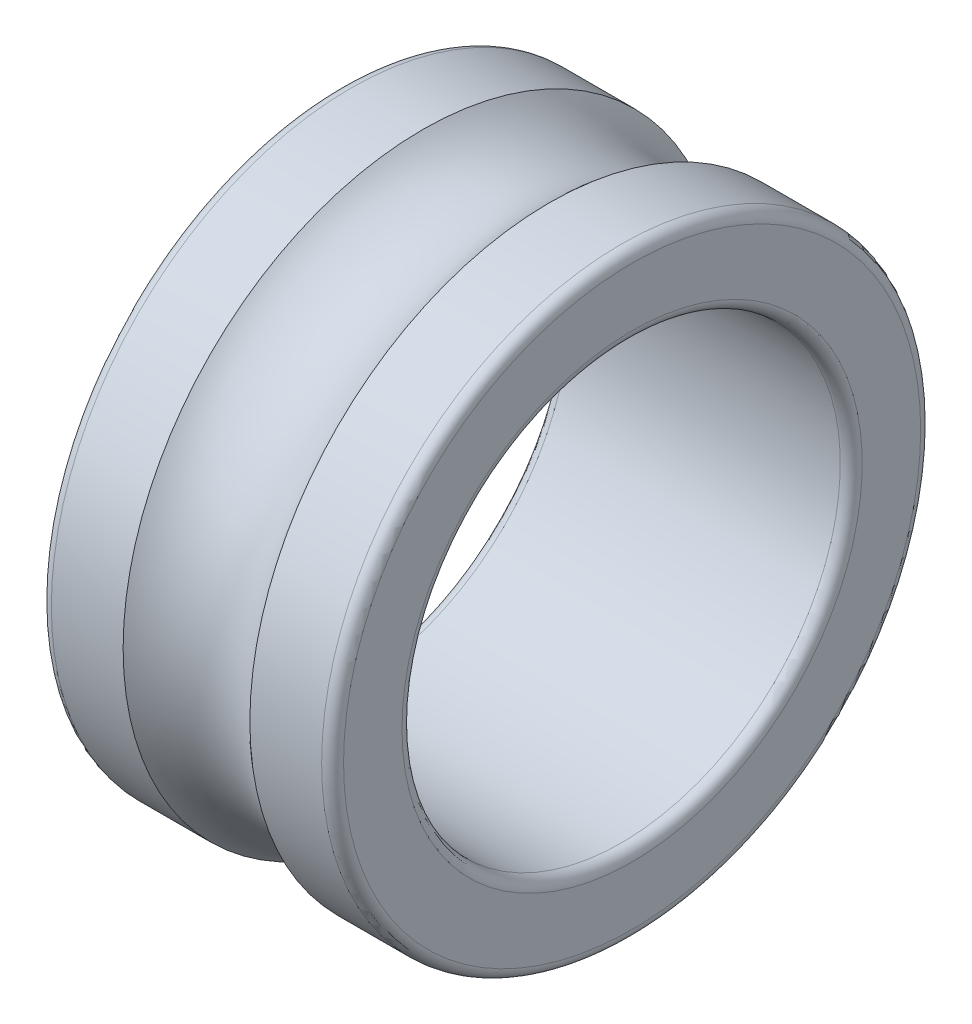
ISO-10303-21;
HEADER;
FILE_DESCRIPTION(('STEP AP214'),'2;1');
FILE_NAME('part.step','',(''),(''),'','','');
FILE_SCHEMA(('AUTOMOTIVE_DESIGN { 1 0 10303 214 1 1 1 1 }'));
ENDSEC;
DATA;
#1=APPLICATION_CONTEXT('core data for automotive mechanical design processes');
#2=APPLICATION_PROTOCOL_DEFINITION('international standard','automotive_design',2000,#1);
#3=PRODUCT_CONTEXT('',#1,'mechanical');
#4=PRODUCT('Part','Part','',(#3));
#5=PRODUCT_RELATED_PRODUCT_CATEGORY('part','',(#4));
#6=PRODUCT_DEFINITION_FORMATION('','',#4);
#7=PRODUCT_DEFINITION_CONTEXT('part definition',#1,'design');
#8=PRODUCT_DEFINITION('design','',#6,#7);
#9=PRODUCT_DEFINITION_SHAPE('','',#8);
#10=(LENGTH_UNIT() NAMED_UNIT(*) SI_UNIT(.MILLI.,.METRE.));
#11=(NAMED_UNIT(*) PLANE_ANGLE_UNIT() SI_UNIT($,.RADIAN.));
#12=(NAMED_UNIT(*) SI_UNIT($,.STERADIAN.) SOLID_ANGLE_UNIT());
#13=UNCERTAINTY_MEASURE_WITH_UNIT(LENGTH_MEASURE(1.E-05),#10,'distance_accuracy_value','');
#14=(GEOMETRIC_REPRESENTATION_CONTEXT(3) GLOBAL_UNCERTAINTY_ASSIGNED_CONTEXT((#13)) GLOBAL_UNIT_ASSIGNED_CONTEXT((#10,
#11,#12)) REPRESENTATION_CONTEXT('',''));
#15=CARTESIAN_POINT('',(0.,0.,0.));
#16=DIRECTION('',(0.,0.,1.));
#17=DIRECTION('',(1.,0.,0.));
#18=AXIS2_PLACEMENT_3D('',#15,#16,#17);
#19=CARTESIAN_POINT('',(-4.,0.,0.));
#20=DIRECTION('',(-1.,0.,0.));
#21=DIRECTION('',(0.,0.,1.));
#22=AXIS2_PLACEMENT_3D('',#19,#20,#21);
#23=TOROIDAL_SURFACE('',#22,10.,2.5);
#24=CARTESIAN_POINT('',(-5.73493515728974,0.,0.));
#25=DIRECTION('',(-1.,0.,0.));
#26=DIRECTION('',(0.,0.,1.));
#27=AXIS2_PLACEMENT_3D('',#24,#25,#26);
#28=CIRCLE('',#27,8.2);
#29=CARTESIAN_POINT('',(-5.73493515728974,0.,8.2));
#30=VERTEX_POINT('',#29);
#31=EDGE_CURVE('E10',#30,#30,#28,.T.);
#32=ORIENTED_EDGE('',*,*,#31,.F.);
#33=EDGE_LOOP('',(#32));
#34=FACE_BOUND('',#33,.T.);
#35=CARTESIAN_POINT('',(-2.26506484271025,0.,0.));
#36=DIRECTION('',(-1.,0.,0.));
#37=DIRECTION('',(0.,0.,1.));
#38=AXIS2_PLACEMENT_3D('',#35,#36,#37);
#39=CIRCLE('',#38,8.2);
#40=CARTESIAN_POINT('',(-2.26506484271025,0.,8.2));
#41=VERTEX_POINT('',#40);
#42=EDGE_CURVE('E388',#41,#41,#39,.T.);
#43=ORIENTED_EDGE('',*,*,#42,.T.);
#44=EDGE_LOOP('',(#43));
#45=FACE_BOUND('',#44,.T.);
#46=ADVANCED_FACE('F354',(#34,#45),#23,.F.);
#47=CARTESIAN_POINT('',(-60.,0.,0.));
#48=DIRECTION('',(-1.,0.,0.));
#49=DIRECTION('',(0.,0.,1.));
#50=AXIS2_PLACEMENT_3D('',#47,#48,#49);
#51=CYLINDRICAL_SURFACE('',#50,8.2);
#52=CARTESIAN_POINT('',(-7.69999999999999,0.,0.));
#53=DIRECTION('',(-1.,0.,0.));
#54=DIRECTION('',(0.,0.,1.));
#55=AXIS2_PLACEMENT_3D('',#52,#53,#54);
#56=CIRCLE('',#55,8.2);
#57=CARTESIAN_POINT('',(-7.69999999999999,0.,8.2));
#58=VERTEX_POINT('',#57);
#59=EDGE_CURVE('E360',#58,#58,#56,.T.);
#60=ORIENTED_EDGE('',*,*,#59,.F.);
#61=EDGE_LOOP('',(#60));
#62=FACE_BOUND('',#61,.T.);
#63=ORIENTED_EDGE('',*,*,#31,.T.);
#64=EDGE_LOOP('',(#63));
#65=FACE_BOUND('',#64,.T.);
#66=ADVANCED_FACE('F437',(#62,#65),#51,.T.);
#67=CARTESIAN_POINT('',(-7.69999999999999,0.,0.));
#68=DIRECTION('',(-1.,0.,0.));
#69=DIRECTION('',(0.,0.,1.));
#70=AXIS2_PLACEMENT_3D('',#67,#68,#69);
#71=TOROIDAL_SURFACE('',#70,7.9,0.3);
#72=CARTESIAN_POINT('',(-7.99999999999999,0.,0.));
#73=DIRECTION('',(-1.,0.,0.));
#74=DIRECTION('',(0.,0.,1.));
#75=AXIS2_PLACEMENT_3D('',#72,#73,#74);
#76=CIRCLE('',#75,7.9);
#77=CARTESIAN_POINT('',(-7.99999999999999,0.,7.9));
#78=VERTEX_POINT('',#77);
#79=EDGE_CURVE('E364',#78,#78,#76,.T.);
#80=ORIENTED_EDGE('',*,*,#79,.F.);
#81=EDGE_LOOP('',(#80));
#82=FACE_BOUND('',#81,.T.);
#83=ORIENTED_EDGE('',*,*,#59,.T.);
#84=EDGE_LOOP('',(#83));
#85=FACE_BOUND('',#84,.T.);
#86=ADVANCED_FACE('F432',(#82,#85),#71,.T.);
#87=CARTESIAN_POINT('',(-7.99999999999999,7.9,0.));
#88=DIRECTION('',(1.,0.,0.));
#89=DIRECTION('',(0.,0.,-1.));
#90=AXIS2_PLACEMENT_3D('',#87,#88,#89);
#91=PLANE('',#90);
#92=CARTESIAN_POINT('',(-7.99999999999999,0.,0.));
#93=DIRECTION('',(-1.,0.,0.));
#94=DIRECTION('',(0.,0.,1.));
#95=AXIS2_PLACEMENT_3D('',#92,#93,#94);
#96=CIRCLE('',#95,6.3);
#97=CARTESIAN_POINT('',(-7.99999999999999,0.,6.3));
#98=VERTEX_POINT('',#97);
#99=EDGE_CURVE('E368',#98,#98,#96,.T.);
#100=ORIENTED_EDGE('',*,*,#99,.F.);
#101=EDGE_LOOP('',(#100));
#102=FACE_BOUND('',#101,.T.);
#103=ORIENTED_EDGE('',*,*,#79,.T.);
#104=EDGE_LOOP('',(#103));
#105=FACE_BOUND('',#104,.T.);
#106=ADVANCED_FACE('F426',(#102,#105),#91,.F.);
#107=CARTESIAN_POINT('',(-7.69999999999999,0.,0.));
#108=DIRECTION('',(-1.,0.,0.));
#109=DIRECTION('',(0.,0.,1.));
#110=AXIS2_PLACEMENT_3D('',#107,#108,#109);
#111=TOROIDAL_SURFACE('',#110,6.3,0.3);
#112=CARTESIAN_POINT('',(-7.69999999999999,0.,0.));
#113=DIRECTION('',(-1.,0.,0.));
#114=DIRECTION('',(0.,0.,1.));
#115=AXIS2_PLACEMENT_3D('',#112,#113,#114);
#116=CIRCLE('',#115,6.);
#117=CARTESIAN_POINT('',(-7.69999999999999,0.,6.));
#118=VERTEX_POINT('',#117);
#119=EDGE_CURVE('E373',#118,#118,#116,.T.);
#120=ORIENTED_EDGE('',*,*,#119,.F.);
#121=EDGE_LOOP('',(#120));
#122=FACE_BOUND('',#121,.T.);
#123=ORIENTED_EDGE('',*,*,#99,.T.);
#124=EDGE_LOOP('',(#123));
#125=FACE_BOUND('',#124,.T.);
#126=ADVANCED_FACE('F420',(#122,#125),#111,.T.);
#127=CARTESIAN_POINT('',(-60.,0.,0.));
#128=DIRECTION('',(-1.,0.,0.));
#129=DIRECTION('',(0.,0.,1.));
#130=AXIS2_PLACEMENT_3D('',#127,#128,#129);
#131=CYLINDRICAL_SURFACE('',#130,6.);
#132=CARTESIAN_POINT('',(-0.300000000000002,0.,0.));
#133=DIRECTION('',(-1.,0.,0.));
#134=DIRECTION('',(0.,0.,1.));
#135=AXIS2_PLACEMENT_3D('',#132,#133,#134);
#136=CIRCLE('',#135,6.);
#137=CARTESIAN_POINT('',(-0.300000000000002,0.,6.));
#138=VERTEX_POINT('',#137);
#139=EDGE_CURVE('E376',#138,#138,#136,.T.);
#140=ORIENTED_EDGE('',*,*,#139,.F.);
#141=EDGE_LOOP('',(#140));
#142=FACE_BOUND('',#141,.T.);
#143=ORIENTED_EDGE('',*,*,#119,.T.);
#144=EDGE_LOOP('',(#143));
#145=FACE_BOUND('',#144,.T.);
#146=ADVANCED_FACE('F414',(#142,#145),#131,.F.);
#147=CARTESIAN_POINT('',(-0.300000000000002,0.,0.));
#148=DIRECTION('',(-1.,0.,0.));
#149=DIRECTION('',(0.,0.,1.));
#150=AXIS2_PLACEMENT_3D('',#147,#148,#149);
#151=TOROIDAL_SURFACE('',#150,6.3,0.3);
#152=CARTESIAN_POINT('',(0.,0.,0.));
#153=DIRECTION('',(-1.,0.,0.));
#154=DIRECTION('',(0.,0.,1.));
#155=AXIS2_PLACEMENT_3D('',#152,#153,#154);
#156=CIRCLE('',#155,6.3);
#157=CARTESIAN_POINT('',(0.,0.,6.3));
#158=VERTEX_POINT('',#157);
#159=EDGE_CURVE('E379',#158,#158,#156,.T.);
#160=ORIENTED_EDGE('',*,*,#159,.F.);
#161=EDGE_LOOP('',(#160));
#162=FACE_BOUND('',#161,.T.);
#163=ORIENTED_EDGE('',*,*,#139,.T.);
#164=EDGE_LOOP('',(#163));
#165=FACE_BOUND('',#164,.T.);
#166=ADVANCED_FACE('F408',(#162,#165),#151,.T.);
#167=CARTESIAN_POINT('',(0.,6.3,0.));
#168=DIRECTION('',(-1.,0.,0.));
#169=DIRECTION('',(0.,0.,1.));
#170=AXIS2_PLACEMENT_3D('',#167,#168,#169);
#171=PLANE('',#170);
#172=CARTESIAN_POINT('',(0.,0.,0.));
#173=DIRECTION('',(-1.,0.,0.));
#174=DIRECTION('',(0.,0.,1.));
#175=AXIS2_PLACEMENT_3D('',#172,#173,#174);
#176=CIRCLE('',#175,7.9);
#177=CARTESIAN_POINT('',(0.,0.,7.9));
#178=VERTEX_POINT('',#177);
#179=EDGE_CURVE('E382',#178,#178,#176,.T.);
#180=ORIENTED_EDGE('',*,*,#179,.F.);
#181=EDGE_LOOP('',(#180));
#182=FACE_BOUND('',#181,.T.);
#183=ORIENTED_EDGE('',*,*,#159,.T.);
#184=EDGE_LOOP('',(#183));
#185=FACE_BOUND('',#184,.T.);
#186=ADVANCED_FACE('F402',(#182,#185),#171,.F.);
#187=CARTESIAN_POINT('',(-0.300000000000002,0.,0.));
#188=DIRECTION('',(-1.,0.,0.));
#189=DIRECTION('',(0.,0.,1.));
#190=AXIS2_PLACEMENT_3D('',#187,#188,#189);
#191=TOROIDAL_SURFACE('',#190,7.9,0.3);
#192=CARTESIAN_POINT('',(-0.300000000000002,0.,0.));
#193=DIRECTION('',(-1.,0.,0.));
#194=DIRECTION('',(0.,0.,1.));
#195=AXIS2_PLACEMENT_3D('',#192,#193,#194);
#196=CIRCLE('',#195,8.2);
#197=CARTESIAN_POINT('',(-0.300000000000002,0.,8.2));
#198=VERTEX_POINT('',#197);
#199=EDGE_CURVE('E385',#198,#198,#196,.T.);
#200=ORIENTED_EDGE('',*,*,#199,.F.);
#201=EDGE_LOOP('',(#200));
#202=FACE_BOUND('',#201,.T.);
#203=ORIENTED_EDGE('',*,*,#179,.T.);
#204=EDGE_LOOP('',(#203));
#205=FACE_BOUND('',#204,.T.);
#206=ADVANCED_FACE('F396',(#202,#205),#191,.T.);
#207=CARTESIAN_POINT('',(-60.,0.,0.));
#208=DIRECTION('',(-1.,0.,0.));
#209=DIRECTION('',(0.,0.,1.));
#210=AXIS2_PLACEMENT_3D('',#207,#208,#209);
#211=CYLINDRICAL_SURFACE('',#210,8.2);
#212=ORIENTED_EDGE('',*,*,#42,.F.);
#213=EDGE_LOOP('',(#212));
#214=FACE_BOUND('',#213,.T.);
#215=ORIENTED_EDGE('',*,*,#199,.T.);
#216=EDGE_LOOP('',(#215));
#217=FACE_BOUND('',#216,.T.);
#218=ADVANCED_FACE('F393',(#214,#217),#211,.T.);
#219=CLOSED_SHELL('',(#46,#66,#86,#106,#126,#146,#166,#186,#206,#218));
#220=MANIFOLD_SOLID_BREP('B2',#219);
#221=ADVANCED_BREP_SHAPE_REPRESENTATION('',(#18,#220),#14);
#222=SHAPE_DEFINITION_REPRESENTATION(#9,#221);
ENDSEC;
END-ISO-10303-21;
